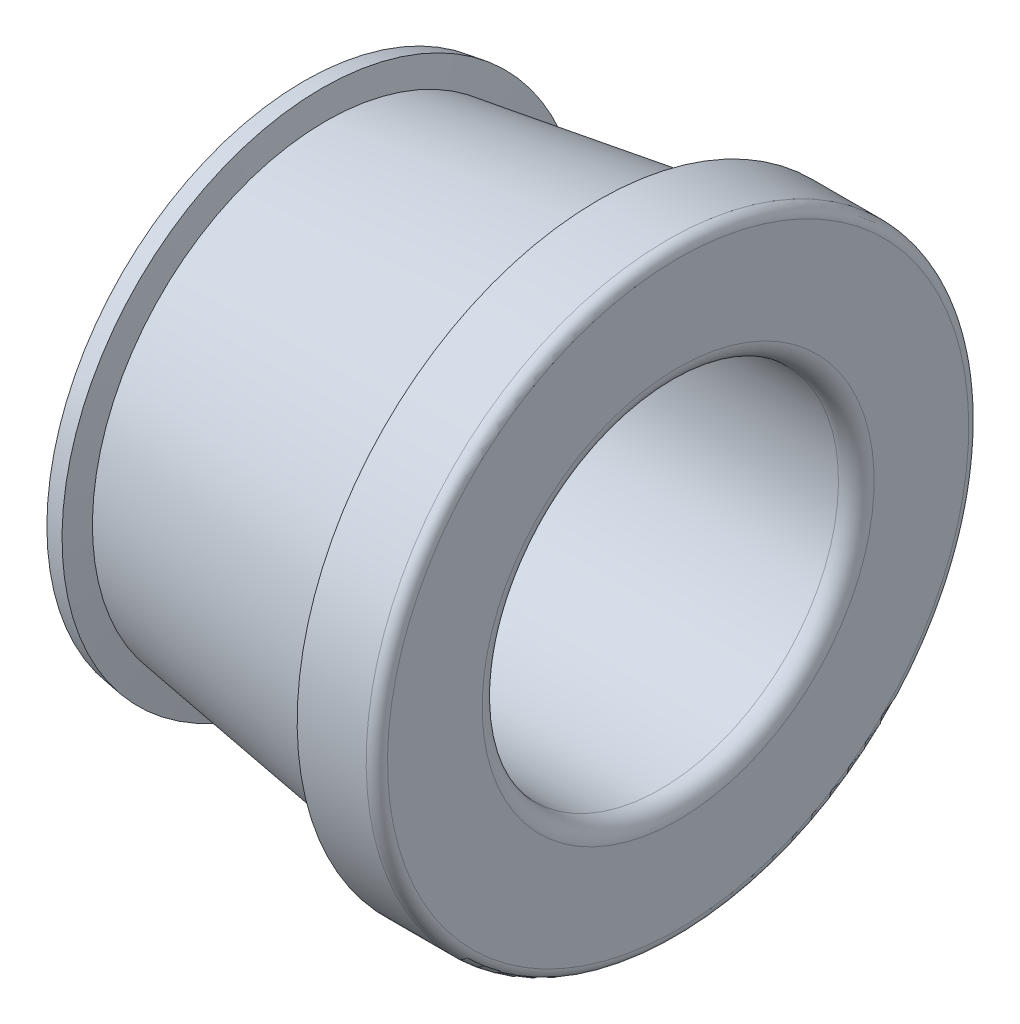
from build123d import *


with BuildPart() as part:
    # Esquisse2 → Base-R_volution (revolve)
    with BuildSketch(Plane.XY):
        with BuildLine():
            Line((8.25, 11), (8.25, 16.311676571))
            ThreePointArc((8.25, 16.311676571), (8.074264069, 16.735940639), (7.65, 16.911676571))
            Line((7.65, 16.911676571), (3.777390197, 16.911676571))
            Line((3.777390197, 16.911676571), (4, 15.428286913))
            Line((4, 15.428286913), (-11.527390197, 13.098117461))
            Line((-11.527390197, 13.098117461), (-11.75, 14.581507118))
            Line((-11.75, 14.581507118), (-12.75, 14.431438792))
            Line((-12.75, 14.431438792), (-12.75, 10.6))
            ThreePointArc((-12.75, 10.6), (-12.574264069, 10.175735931), (-12.15, 10))
            Line((-12.15, 10), (7.25, 10))
            ThreePointArc((7.25, 10), (7.957106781, 10.292893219), (8.25, 11))
        make_face()
    revolve(axis=Axis((8.25, 0, 0), (-1, 0, 0)))


solid = part.part
